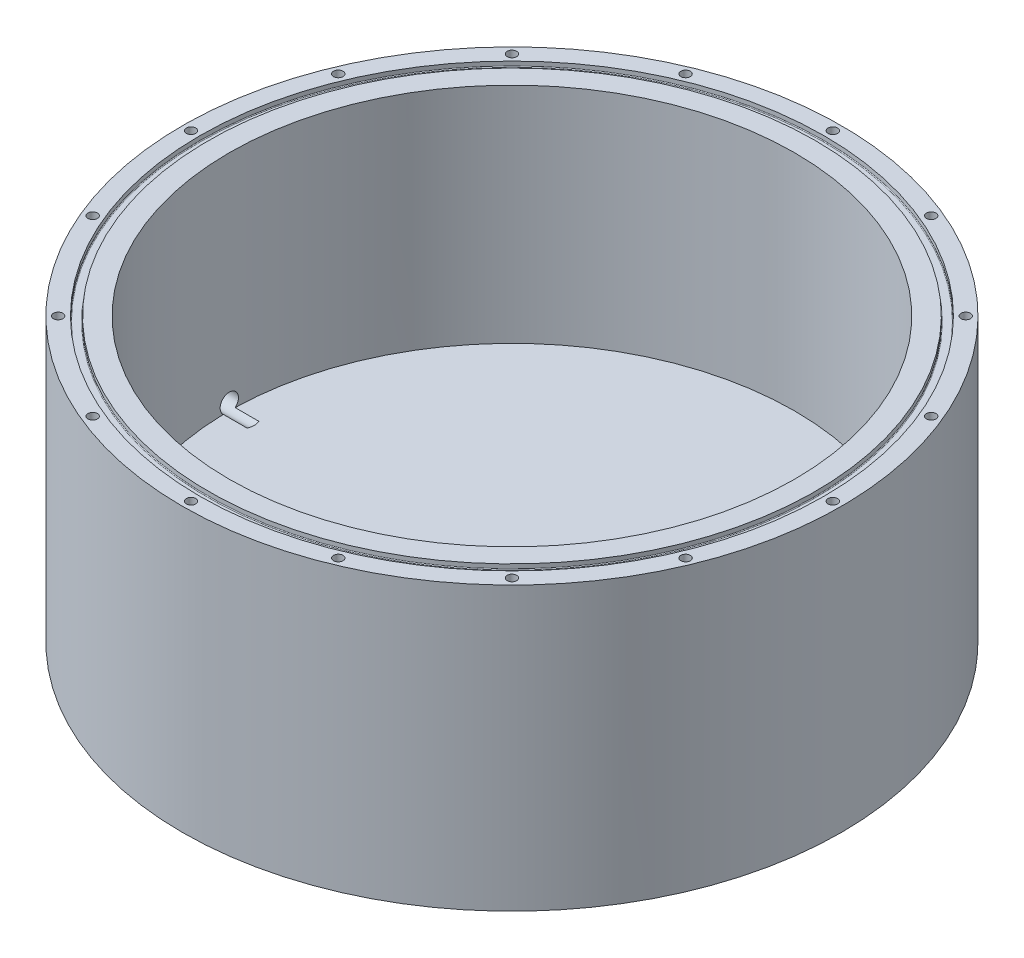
from build123d import *

# Parameters (mm, degrees)
SKETCH1_W                    = 355.6
SKETCH1_H                    = 355.6
BOSS_EXTRUDE1_DEPTH          = 152.4
SKETCH4_R                    = 274.890082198
SKETCH4_R_2                  = 177.8
CUT_EXTRUDE1_DEPTH           = 295.026257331
CIRPATTERN1_COUNT            = 16
F_7_16_20_TAPPED_HOLE1_D     = 9.92124
F_7_16_20_TAPPED_HOLE1_DEPTH = 38.1
F_7_16_20_TAPPED_HOLE1_TIP   = 2.980641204


with BuildPart() as part:
    # Sketch1 → Boss-Extrude1 (new body)
    with BuildSketch(Plane(origin=(0, 0, 0), x_dir=(1, 0, 0), z_dir=(0, 1, 0))):
        Rectangle(SKETCH1_W, SKETCH1_H)
    extrude(amount=BOSS_EXTRUDE1_DEPTH)

    # Sketch3 → Cut-Revolve1 (revolve, cut)
    with BuildSketch(Plane.XY, mode=Mode.PRIVATE) as cut_revolve1_sk:
        with BuildLine():
            Line((-168.4274, 152.4), (-168.4274, 150.1648))
            ThreePointArc((-168.4274, 150.1648), (-168.308368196, 149.877431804), (-168.021, 149.7584))
            Line((-168.021, 149.7584), (-164.211, 149.7584))
            ThreePointArc((-164.211, 149.7584), (-163.923631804, 149.877431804), (-163.8046, 150.1648))
            Line((-163.8046, 150.1648), (-163.8046, 152.4))
            Line((-163.8046, 152.4), (-152.54, 152.4))
            Line((-152.54, 152.4), (-152.54, 31.75))
            Line((-152.54, 31.75), (0, 31.75))
            Line((0, 31.75), (0, 162.115156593))
            Line((0, 162.115156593), (-168.4274, 162.115156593))
            Line((-168.4274, 162.115156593), (-168.4274, 152.4))
        make_face()
    revolve(cut_revolve1_sk.sketch.rotate(Axis((0, 0, 0), (0, 1, 0)), 270), axis=Axis((0, 0, 0), (0, 1, 0)), mode=Mode.SUBTRACT)

    # Sketch4 → Cut-Extrude1 (cut, through all)
    with BuildSketch(Plane(origin=(0, 152.4, 0), x_dir=(1, 0, 0), z_dir=(0, 1, 0))):
        Circle(SKETCH4_R)
        with Locations(Location((0, 0, 0), (0, 0, 270))):
            Circle(SKETCH4_R_2, mode=Mode.SUBTRACT)
    extrude(amount=-CUT_EXTRUDE1_DEPTH, mode=Mode.SUBTRACT)

    # Sketch5 → 1_4-20 Tapped Hole1 (revolve, cut)
    with BuildSketch(Plane(origin=(0, 152.4, -173.1137), x_dir=(0, 0, 1), z_dir=(1, 0, 0))):
        Polygon((0, 0), (0, 20.583816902), (2.5527, 19.05), (2.5527, 0), align=None)
    f_1_4_20_tapped_hole1 = revolve(axis=Axis((0, 158.75, -173.1137), (0, -1, 0)), mode=Mode.SUBTRACT)

    # CirPattern1: 1_4-20 Tapped Hole1 ×16 about axis
    cirpattern1_axis = Axis((0, 0, 0), (0, 1, 0))
    for i in range(1, CIRPATTERN1_COUNT):
        add(f_1_4_20_tapped_hole1.rotate(cirpattern1_axis, i * 360 / CIRPATTERN1_COUNT), mode=Mode.SUBTRACT)

    # 7_16-20 Tapped Hole1
    with Locations(Plane.ZY.offset(177.8)):
        with Locations((0, 35.56)):
            Hole(F_7_16_20_TAPPED_HOLE1_D / 2, depth=F_7_16_20_TAPPED_HOLE1_DEPTH)
            with Locations((0, 0, -(F_7_16_20_TAPPED_HOLE1_DEPTH + F_7_16_20_TAPPED_HOLE1_TIP / 2))):  # 118° drill point
                Cone(0, F_7_16_20_TAPPED_HOLE1_D / 2, F_7_16_20_TAPPED_HOLE1_TIP, mode=Mode.SUBTRACT)


solid = part.part
